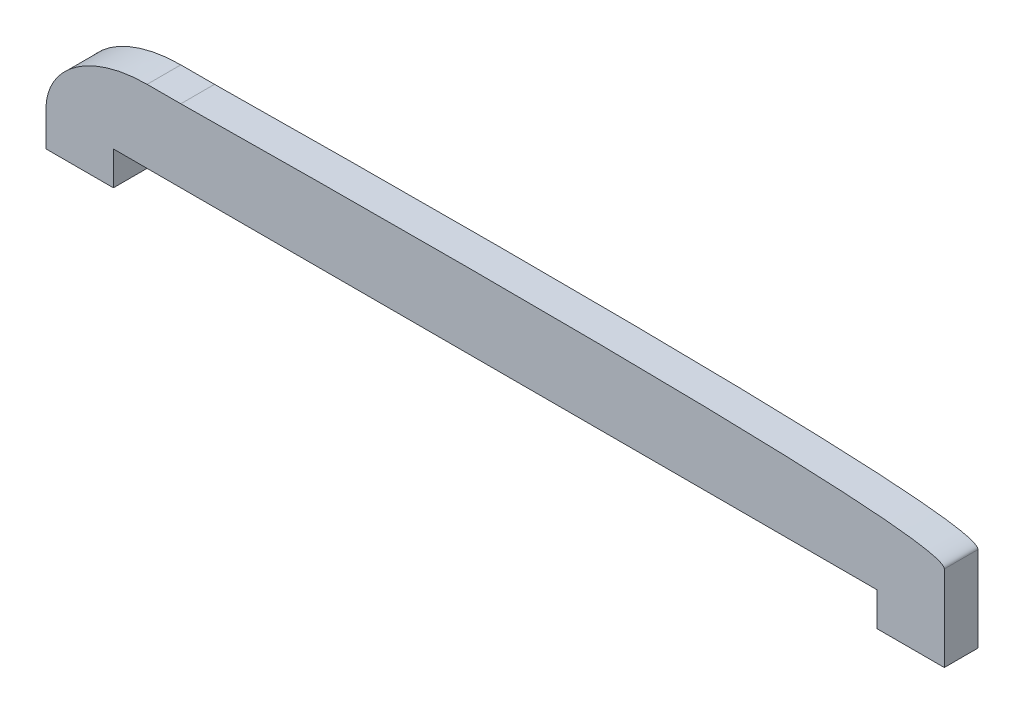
ISO-10303-21;
HEADER;
FILE_DESCRIPTION(('STEP AP214'),'2;1');
FILE_NAME('part.step','',(''),(''),'','','');
FILE_SCHEMA(('AUTOMOTIVE_DESIGN { 1 0 10303 214 1 1 1 1 }'));
ENDSEC;
DATA;
#1=APPLICATION_CONTEXT('core data for automotive mechanical design processes');
#2=APPLICATION_PROTOCOL_DEFINITION('international standard','automotive_design',2000,#1);
#3=PRODUCT_CONTEXT('',#1,'mechanical');
#4=PRODUCT('Part','Part','',(#3));
#5=PRODUCT_RELATED_PRODUCT_CATEGORY('part','',(#4));
#6=PRODUCT_DEFINITION_FORMATION('','',#4);
#7=PRODUCT_DEFINITION_CONTEXT('part definition',#1,'design');
#8=PRODUCT_DEFINITION('design','',#6,#7);
#9=PRODUCT_DEFINITION_SHAPE('','',#8);
#10=(LENGTH_UNIT() NAMED_UNIT(*) SI_UNIT(.MILLI.,.METRE.));
#11=(NAMED_UNIT(*) PLANE_ANGLE_UNIT() SI_UNIT($,.RADIAN.));
#12=(NAMED_UNIT(*) SI_UNIT($,.STERADIAN.) SOLID_ANGLE_UNIT());
#13=UNCERTAINTY_MEASURE_WITH_UNIT(LENGTH_MEASURE(1.E-05),#10,'distance_accuracy_value','');
#14=(GEOMETRIC_REPRESENTATION_CONTEXT(3) GLOBAL_UNCERTAINTY_ASSIGNED_CONTEXT((#13)) GLOBAL_UNIT_ASSIGNED_CONTEXT((#10,
#11,#12)) REPRESENTATION_CONTEXT('',''));
#15=CARTESIAN_POINT('',(0.,0.,0.));
#16=DIRECTION('',(0.,0.,1.));
#17=DIRECTION('',(1.,0.,0.));
#18=AXIS2_PLACEMENT_3D('',#15,#16,#17);
#19=CARTESIAN_POINT('',(-3.17499999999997,3.17500000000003,-3.175));
#20=DIRECTION('',(1.,0.,0.));
#21=DIRECTION('',(0.,0.,-1.));
#22=AXIS2_PLACEMENT_3D('',#19,#20,#21);
#23=PLANE('',#22);
#24=DIRECTION('',(0.,1.,0.));
#25=VECTOR('',#24,1.);
#26=CARTESIAN_POINT('',(-3.17499999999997,3.17500000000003,0.));
#27=LINE('',#26,#25);
#28=CARTESIAN_POINT('',(-3.17499999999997,0.,0.));
#29=VERTEX_POINT('',#28);
#30=CARTESIAN_POINT('',(-3.17499999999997,3.17500000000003,0.));
#31=VERTEX_POINT('',#30);
#32=EDGE_CURVE('E200',#29,#31,#27,.T.);
#33=ORIENTED_EDGE('',*,*,#32,.F.);
#34=DIRECTION('',(0.,0.,1.));
#35=VECTOR('',#34,1.);
#36=CARTESIAN_POINT('',(-3.17499999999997,0.,-3.175));
#37=LINE('',#36,#35);
#38=CARTESIAN_POINT('',(-3.17499999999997,0.,-3.175));
#39=VERTEX_POINT('',#38);
#40=EDGE_CURVE('E11',#39,#29,#37,.T.);
#41=ORIENTED_EDGE('',*,*,#40,.F.);
#42=DIRECTION('',(0.,1.,0.));
#43=VECTOR('',#42,1.);
#44=CARTESIAN_POINT('',(-3.17499999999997,3.17500000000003,-3.175));
#45=LINE('',#44,#43);
#46=CARTESIAN_POINT('',(-3.17499999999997,3.17500000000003,-3.175));
#47=VERTEX_POINT('',#46);
#48=EDGE_CURVE('E178',#39,#47,#45,.T.);
#49=ORIENTED_EDGE('',*,*,#48,.T.);
#50=DIRECTION('',(0.,0.,1.));
#51=VECTOR('',#50,1.);
#52=CARTESIAN_POINT('',(-3.17499999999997,3.17500000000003,-3.175));
#53=LINE('',#52,#51);
#54=EDGE_CURVE('E33',#47,#31,#53,.T.);
#55=ORIENTED_EDGE('',*,*,#54,.T.);
#56=EDGE_LOOP('',(#33,#41,#49,#55));
#57=FACE_BOUND('',#56,.T.);
#58=ADVANCED_FACE('F30',(#57),#23,.T.);
#59=CARTESIAN_POINT('',(-3.17499999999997,0.,-3.175));
#60=DIRECTION('',(0.,-1.,0.));
#61=DIRECTION('',(0.,0.,-1.));
#62=AXIS2_PLACEMENT_3D('',#59,#60,#61);
#63=PLANE('',#62);
#64=DIRECTION('',(1.,0.,0.));
#65=VECTOR('',#64,1.);
#66=CARTESIAN_POINT('',(-3.17499999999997,0.,0.));
#67=LINE('',#66,#65);
#68=CARTESIAN_POINT('',(-9.52499999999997,0.,0.));
#69=VERTEX_POINT('',#68);
#70=EDGE_CURVE('E179',#69,#29,#67,.T.);
#71=ORIENTED_EDGE('',*,*,#70,.F.);
#72=DIRECTION('',(0.,0.,1.));
#73=VECTOR('',#72,1.);
#74=CARTESIAN_POINT('',(-9.52499999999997,0.,-3.175));
#75=LINE('',#74,#73);
#76=CARTESIAN_POINT('',(-9.52499999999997,0.,-3.175));
#77=VERTEX_POINT('',#76);
#78=EDGE_CURVE('E39',#77,#69,#75,.T.);
#79=ORIENTED_EDGE('',*,*,#78,.F.);
#80=DIRECTION('',(1.,0.,0.));
#81=VECTOR('',#80,1.);
#82=CARTESIAN_POINT('',(-3.17499999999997,0.,-3.175));
#83=LINE('',#82,#81);
#84=EDGE_CURVE('E129',#77,#39,#83,.T.);
#85=ORIENTED_EDGE('',*,*,#84,.T.);
#86=ORIENTED_EDGE('',*,*,#40,.T.);
#87=EDGE_LOOP('',(#71,#79,#85,#86));
#88=FACE_BOUND('',#87,.T.);
#89=ADVANCED_FACE('F252',(#88),#63,.T.);
#90=CARTESIAN_POINT('',(-9.52499999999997,0.,-3.175));
#91=DIRECTION('',(-1.,0.,0.));
#92=DIRECTION('',(0.,0.,1.));
#93=AXIS2_PLACEMENT_3D('',#90,#91,#92);
#94=PLANE('',#93);
#95=DIRECTION('',(0.,-1.,0.));
#96=VECTOR('',#95,1.);
#97=CARTESIAN_POINT('',(-9.52499999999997,0.,0.));
#98=LINE('',#97,#96);
#99=CARTESIAN_POINT('',(-9.52499999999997,3.17500000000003,0.));
#100=VERTEX_POINT('',#99);
#101=EDGE_CURVE('E116',#100,#69,#98,.T.);
#102=ORIENTED_EDGE('',*,*,#101,.F.);
#103=DIRECTION('',(0.,0.,1.));
#104=VECTOR('',#103,1.);
#105=CARTESIAN_POINT('',(-9.52499999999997,3.17500000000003,-3.175));
#106=LINE('',#105,#104);
#107=CARTESIAN_POINT('',(-9.52499999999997,3.17500000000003,-3.175));
#108=VERTEX_POINT('',#107);
#109=EDGE_CURVE('E111',#108,#100,#106,.T.);
#110=ORIENTED_EDGE('',*,*,#109,.F.);
#111=DIRECTION('',(0.,-1.,0.));
#112=VECTOR('',#111,1.);
#113=CARTESIAN_POINT('',(-9.52499999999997,0.,-3.175));
#114=LINE('',#113,#112);
#115=EDGE_CURVE('E114',#108,#77,#114,.T.);
#116=ORIENTED_EDGE('',*,*,#115,.T.);
#117=ORIENTED_EDGE('',*,*,#78,.T.);
#118=EDGE_LOOP('',(#102,#110,#116,#117));
#119=FACE_BOUND('',#118,.T.);
#120=ADVANCED_FACE('F113',(#119),#94,.T.);
#121=CARTESIAN_POINT('',(0.,10.0330000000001,-3.175));
#122=CARTESIAN_POINT('',(-5.36068181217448,10.0265805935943,-3.175));
#123=CARTESIAN_POINT('',(-9.56811521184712,6.95514030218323,-3.175));
#124=CARTESIAN_POINT('',(-9.52499999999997,3.17500000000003,-3.175));
#125=B_SPLINE_CURVE_WITH_KNOTS('',3,(#121,#122,#123,#124),.UNSPECIFIED.,.F.,.F.,(4,4),(0.,1.),.UNSPECIFIED.);
#126=DIRECTION('',(0.,0.,1.));
#127=VECTOR('',#126,1.);
#128=SURFACE_OF_LINEAR_EXTRUSION('',#125,#127);
#129=CARTESIAN_POINT('',(0.,10.0330000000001,0.));
#130=CARTESIAN_POINT('',(-5.36068181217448,10.0265805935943,0.));
#131=CARTESIAN_POINT('',(-9.56811521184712,6.95514030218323,0.));
#132=CARTESIAN_POINT('',(-9.52499999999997,3.17500000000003,0.));
#133=B_SPLINE_CURVE_WITH_KNOTS('',3,(#129,#130,#131,#132),.UNSPECIFIED.,.F.,.F.,(4,4),(0.,1.),.UNSPECIFIED.);
#134=CARTESIAN_POINT('',(0.,10.0330000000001,0.));
#135=VERTEX_POINT('',#134);
#136=EDGE_CURVE('E184',#135,#100,#133,.T.);
#137=ORIENTED_EDGE('',*,*,#136,.F.);
#138=DIRECTION('',(0.,0.,1.));
#139=VECTOR('',#138,1.);
#140=CARTESIAN_POINT('',(0.,10.0330000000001,-3.175));
#141=LINE('',#140,#139);
#142=CARTESIAN_POINT('',(0.,10.0330000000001,-3.175));
#143=VERTEX_POINT('',#142);
#144=EDGE_CURVE('E121',#143,#135,#141,.T.);
#145=ORIENTED_EDGE('',*,*,#144,.F.);
#146=EDGE_CURVE('E127',#143,#108,#125,.T.);
#147=ORIENTED_EDGE('',*,*,#146,.T.);
#148=ORIENTED_EDGE('',*,*,#109,.T.);
#149=EDGE_LOOP('',(#137,#145,#147,#148));
#150=FACE_BOUND('',#149,.T.);
#151=ADVANCED_FACE('F131',(#150),#128,.T.);
#152=CARTESIAN_POINT('',(0.,10.0330000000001,-3.175));
#153=DIRECTION('',(0.,1.,0.));
#154=DIRECTION('',(0.,0.,1.));
#155=AXIS2_PLACEMENT_3D('',#152,#153,#154);
#156=PLANE('',#155);
#157=DIRECTION('',(-1.,0.,0.));
#158=VECTOR('',#157,1.);
#159=CARTESIAN_POINT('',(0.,10.0330000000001,0.));
#160=LINE('',#159,#158);
#161=CARTESIAN_POINT('',(3.17500000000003,10.0330000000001,0.));
#162=VERTEX_POINT('',#161);
#163=EDGE_CURVE('E219',#162,#135,#160,.T.);
#164=ORIENTED_EDGE('',*,*,#163,.F.);
#165=DIRECTION('',(0.,0.,1.));
#166=VECTOR('',#165,1.);
#167=CARTESIAN_POINT('',(3.17500000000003,10.0330000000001,-3.175));
#168=LINE('',#167,#166);
#169=CARTESIAN_POINT('',(3.17500000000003,10.0330000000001,-3.175));
#170=VERTEX_POINT('',#169);
#171=EDGE_CURVE('E190',#170,#162,#168,.T.);
#172=ORIENTED_EDGE('',*,*,#171,.F.);
#173=DIRECTION('',(-1.,0.,0.));
#174=VECTOR('',#173,1.);
#175=CARTESIAN_POINT('',(0.,10.0330000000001,-3.175));
#176=LINE('',#175,#174);
#177=EDGE_CURVE('E132',#170,#143,#176,.T.);
#178=ORIENTED_EDGE('',*,*,#177,.T.);
#179=ORIENTED_EDGE('',*,*,#144,.T.);
#180=EDGE_LOOP('',(#164,#172,#178,#179));
#181=FACE_BOUND('',#180,.T.);
#182=ADVANCED_FACE('F148',(#181),#156,.T.);
#183=CARTESIAN_POINT('',(75.1025007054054,8.04642457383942,-3.175));
#184=CARTESIAN_POINT('',(74.9511238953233,10.4583631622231,-3.175));
#185=CARTESIAN_POINT('',(30.3685065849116,10.3556554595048,-3.175));
#186=CARTESIAN_POINT('',(3.17500000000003,10.0330000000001,-3.175));
#187=B_SPLINE_CURVE_WITH_KNOTS('',3,(#183,#184,#185,#186),.UNSPECIFIED.,.F.,.F.,(4,4),(0.,1.),.UNSPECIFIED.);
#188=DIRECTION('',(0.,0.,1.));
#189=VECTOR('',#188,1.);
#190=SURFACE_OF_LINEAR_EXTRUSION('',#187,#189);
#191=CARTESIAN_POINT('',(75.1025007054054,8.04642457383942,0.));
#192=CARTESIAN_POINT('',(74.9511238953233,10.4583631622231,0.));
#193=CARTESIAN_POINT('',(30.3685065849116,10.3556554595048,0.));
#194=CARTESIAN_POINT('',(3.17500000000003,10.0330000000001,0.));
#195=B_SPLINE_CURVE_WITH_KNOTS('',3,(#191,#192,#193,#194),.UNSPECIFIED.,.F.,.F.,(4,4),(0.,1.),.UNSPECIFIED.);
#196=CARTESIAN_POINT('',(75.1025007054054,8.04642457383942,0.));
#197=VERTEX_POINT('',#196);
#198=EDGE_CURVE('E214',#197,#162,#195,.T.);
#199=ORIENTED_EDGE('',*,*,#198,.F.);
#200=DIRECTION('',(0.,0.,1.));
#201=VECTOR('',#200,1.);
#202=CARTESIAN_POINT('',(75.1025007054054,8.04642457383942,-3.175));
#203=LINE('',#202,#201);
#204=CARTESIAN_POINT('',(75.1025007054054,8.04642457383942,-3.175));
#205=VERTEX_POINT('',#204);
#206=EDGE_CURVE('E192',#205,#197,#203,.T.);
#207=ORIENTED_EDGE('',*,*,#206,.F.);
#208=EDGE_CURVE('E134',#205,#170,#187,.T.);
#209=ORIENTED_EDGE('',*,*,#208,.T.);
#210=ORIENTED_EDGE('',*,*,#171,.T.);
#211=EDGE_LOOP('',(#199,#207,#209,#210));
#212=FACE_BOUND('',#211,.T.);
#213=ADVANCED_FACE('F152',(#212),#190,.T.);
#214=CARTESIAN_POINT('',(75.1025007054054,8.04642457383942,-3.175));
#215=DIRECTION('',(1.,0.,0.));
#216=DIRECTION('',(0.,0.,-1.));
#217=AXIS2_PLACEMENT_3D('',#214,#215,#216);
#218=PLANE('',#217);
#219=DIRECTION('',(0.,1.,0.));
#220=VECTOR('',#219,1.);
#221=CARTESIAN_POINT('',(75.1025007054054,8.04642457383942,0.));
#222=LINE('',#221,#220);
#223=CARTESIAN_POINT('',(75.1025007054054,0.,0.));
#224=VERTEX_POINT('',#223);
#225=EDGE_CURVE('E211',#224,#197,#222,.T.);
#226=ORIENTED_EDGE('',*,*,#225,.F.);
#227=DIRECTION('',(0.,0.,1.));
#228=VECTOR('',#227,1.);
#229=CARTESIAN_POINT('',(75.1025007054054,0.,-3.175));
#230=LINE('',#229,#228);
#231=CARTESIAN_POINT('',(75.1025007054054,0.,-3.175));
#232=VERTEX_POINT('',#231);
#233=EDGE_CURVE('E194',#232,#224,#230,.T.);
#234=ORIENTED_EDGE('',*,*,#233,.F.);
#235=DIRECTION('',(0.,1.,0.));
#236=VECTOR('',#235,1.);
#237=CARTESIAN_POINT('',(75.1025007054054,8.04642457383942,-3.175));
#238=LINE('',#237,#236);
#239=EDGE_CURVE('E164',#232,#205,#238,.T.);
#240=ORIENTED_EDGE('',*,*,#239,.T.);
#241=ORIENTED_EDGE('',*,*,#206,.T.);
#242=EDGE_LOOP('',(#226,#234,#240,#241));
#243=FACE_BOUND('',#242,.T.);
#244=ADVANCED_FACE('F156',(#243),#218,.T.);
#245=CARTESIAN_POINT('',(75.1025007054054,0.,-3.175));
#246=DIRECTION('',(0.,-1.,0.));
#247=DIRECTION('',(0.,0.,-1.));
#248=AXIS2_PLACEMENT_3D('',#245,#246,#247);
#249=PLANE('',#248);
#250=DIRECTION('',(1.,0.,0.));
#251=VECTOR('',#250,1.);
#252=CARTESIAN_POINT('',(75.1025007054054,0.,0.));
#253=LINE('',#252,#251);
#254=CARTESIAN_POINT('',(68.7525007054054,0.,0.));
#255=VERTEX_POINT('',#254);
#256=EDGE_CURVE('E208',#255,#224,#253,.T.);
#257=ORIENTED_EDGE('',*,*,#256,.F.);
#258=DIRECTION('',(0.,0.,1.));
#259=VECTOR('',#258,1.);
#260=CARTESIAN_POINT('',(68.7525007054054,0.,-3.175));
#261=LINE('',#260,#259);
#262=CARTESIAN_POINT('',(68.7525007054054,0.,-3.175));
#263=VERTEX_POINT('',#262);
#264=EDGE_CURVE('E196',#263,#255,#261,.T.);
#265=ORIENTED_EDGE('',*,*,#264,.F.);
#266=DIRECTION('',(1.,0.,0.));
#267=VECTOR('',#266,1.);
#268=CARTESIAN_POINT('',(75.1025007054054,0.,-3.175));
#269=LINE('',#268,#267);
#270=EDGE_CURVE('E170',#263,#232,#269,.T.);
#271=ORIENTED_EDGE('',*,*,#270,.T.);
#272=ORIENTED_EDGE('',*,*,#233,.T.);
#273=EDGE_LOOP('',(#257,#265,#271,#272));
#274=FACE_BOUND('',#273,.T.);
#275=ADVANCED_FACE('F240',(#274),#249,.T.);
#276=CARTESIAN_POINT('',(68.7525007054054,0.,-3.175));
#277=DIRECTION('',(-1.,0.,0.));
#278=DIRECTION('',(0.,0.,1.));
#279=AXIS2_PLACEMENT_3D('',#276,#277,#278);
#280=PLANE('',#279);
#281=DIRECTION('',(0.,-1.,0.));
#282=VECTOR('',#281,1.);
#283=CARTESIAN_POINT('',(68.7525007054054,0.,0.));
#284=LINE('',#283,#282);
#285=CARTESIAN_POINT('',(68.7525007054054,3.17500000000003,0.));
#286=VERTEX_POINT('',#285);
#287=EDGE_CURVE('E205',#286,#255,#284,.T.);
#288=ORIENTED_EDGE('',*,*,#287,.F.);
#289=DIRECTION('',(0.,0.,1.));
#290=VECTOR('',#289,1.);
#291=CARTESIAN_POINT('',(68.7525007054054,3.17500000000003,-3.175));
#292=LINE('',#291,#290);
#293=CARTESIAN_POINT('',(68.7525007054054,3.17500000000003,-3.175));
#294=VERTEX_POINT('',#293);
#295=EDGE_CURVE('E197',#294,#286,#292,.T.);
#296=ORIENTED_EDGE('',*,*,#295,.F.);
#297=DIRECTION('',(0.,-1.,0.));
#298=VECTOR('',#297,1.);
#299=CARTESIAN_POINT('',(68.7525007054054,0.,-3.175));
#300=LINE('',#299,#298);
#301=EDGE_CURVE('E173',#294,#263,#300,.T.);
#302=ORIENTED_EDGE('',*,*,#301,.T.);
#303=ORIENTED_EDGE('',*,*,#264,.T.);
#304=EDGE_LOOP('',(#288,#296,#302,#303));
#305=FACE_BOUND('',#304,.T.);
#306=ADVANCED_FACE('F242',(#305),#280,.T.);
#307=CARTESIAN_POINT('',(68.7525007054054,3.17500000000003,-3.175));
#308=DIRECTION('',(0.,-1.,0.));
#309=DIRECTION('',(0.,0.,-1.));
#310=AXIS2_PLACEMENT_3D('',#307,#308,#309);
#311=PLANE('',#310);
#312=DIRECTION('',(1.,0.,0.));
#313=VECTOR('',#312,1.);
#314=CARTESIAN_POINT('',(68.7525007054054,3.17500000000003,0.));
#315=LINE('',#314,#313);
#316=EDGE_CURVE('E202',#31,#286,#315,.T.);
#317=ORIENTED_EDGE('',*,*,#316,.F.);
#318=ORIENTED_EDGE('',*,*,#54,.F.);
#319=DIRECTION('',(1.,0.,0.));
#320=VECTOR('',#319,1.);
#321=CARTESIAN_POINT('',(68.7525007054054,3.17500000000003,-3.175));
#322=LINE('',#321,#320);
#323=EDGE_CURVE('E176',#47,#294,#322,.T.);
#324=ORIENTED_EDGE('',*,*,#323,.T.);
#325=ORIENTED_EDGE('',*,*,#295,.T.);
#326=EDGE_LOOP('',(#317,#318,#324,#325));
#327=FACE_BOUND('',#326,.T.);
#328=ADVANCED_FACE('F243',(#327),#311,.T.);
#329=CARTESIAN_POINT('',(-6.78892388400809,8.01914533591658,-3.175));
#330=DIRECTION('',(0.,0.,1.));
#331=DIRECTION('',(1.,0.,0.));
#332=AXIS2_PLACEMENT_3D('',#329,#330,#331);
#333=PLANE('',#332);
#334=ORIENTED_EDGE('',*,*,#48,.F.);
#335=ORIENTED_EDGE('',*,*,#84,.F.);
#336=ORIENTED_EDGE('',*,*,#115,.F.);
#337=ORIENTED_EDGE('',*,*,#146,.F.);
#338=ORIENTED_EDGE('',*,*,#177,.F.);
#339=ORIENTED_EDGE('',*,*,#208,.F.);
#340=ORIENTED_EDGE('',*,*,#239,.F.);
#341=ORIENTED_EDGE('',*,*,#270,.F.);
#342=ORIENTED_EDGE('',*,*,#301,.F.);
#343=ORIENTED_EDGE('',*,*,#323,.F.);
#344=EDGE_LOOP('',(#334,#335,#336,#337,#338,#339,#340,#341,#342,#343));
#345=FACE_BOUND('',#344,.T.);
#346=ADVANCED_FACE('F125',(#345),#333,.F.);
#347=CARTESIAN_POINT('',(-6.78892388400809,8.01914533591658,0.));
#348=DIRECTION('',(0.,0.,1.));
#349=DIRECTION('',(1.,0.,0.));
#350=AXIS2_PLACEMENT_3D('',#347,#348,#349);
#351=PLANE('',#350);
#352=ORIENTED_EDGE('',*,*,#32,.T.);
#353=ORIENTED_EDGE('',*,*,#316,.T.);
#354=ORIENTED_EDGE('',*,*,#287,.T.);
#355=ORIENTED_EDGE('',*,*,#256,.T.);
#356=ORIENTED_EDGE('',*,*,#225,.T.);
#357=ORIENTED_EDGE('',*,*,#198,.T.);
#358=ORIENTED_EDGE('',*,*,#163,.T.);
#359=ORIENTED_EDGE('',*,*,#136,.T.);
#360=ORIENTED_EDGE('',*,*,#101,.T.);
#361=ORIENTED_EDGE('',*,*,#70,.T.);
#362=EDGE_LOOP('',(#352,#353,#354,#355,#356,#357,#358,#359,#360,#361));
#363=FACE_BOUND('',#362,.T.);
#364=ADVANCED_FACE('F229',(#363),#351,.T.);
#365=CLOSED_SHELL('',(#58,#89,#120,#151,#182,#213,#244,#275,#306,#328,#346,#364));
#366=MANIFOLD_SOLID_BREP('B2',#365);
#367=ADVANCED_BREP_SHAPE_REPRESENTATION('',(#18,#366),#14);
#368=SHAPE_DEFINITION_REPRESENTATION(#9,#367);
ENDSEC;
END-ISO-10303-21;
